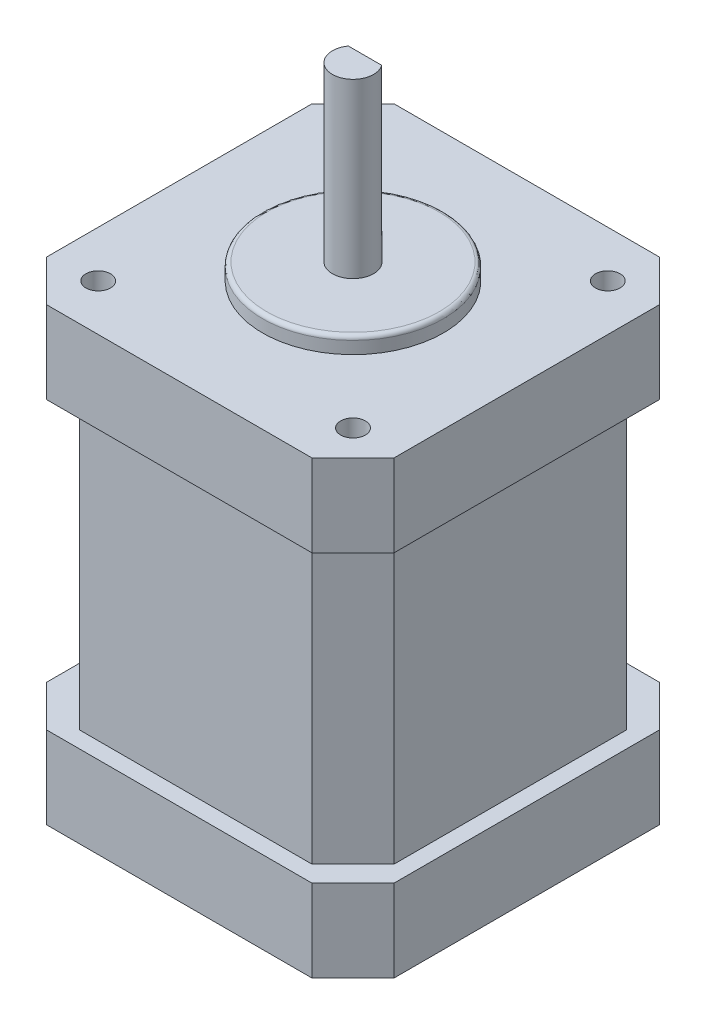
ISO-10303-21;
HEADER;
FILE_DESCRIPTION(('STEP AP214'),'2;1');
FILE_NAME('part.step','',(''),(''),'','','');
FILE_SCHEMA(('AUTOMOTIVE_DESIGN { 1 0 10303 214 1 1 1 1 }'));
ENDSEC;
DATA;
#1=APPLICATION_CONTEXT('core data for automotive mechanical design processes');
#2=APPLICATION_PROTOCOL_DEFINITION('international standard','automotive_design',2000,#1);
#3=PRODUCT_CONTEXT('',#1,'mechanical');
#4=PRODUCT('Part','Part','',(#3));
#5=PRODUCT_RELATED_PRODUCT_CATEGORY('part','',(#4));
#6=PRODUCT_DEFINITION_FORMATION('','',#4);
#7=PRODUCT_DEFINITION_CONTEXT('part definition',#1,'design');
#8=PRODUCT_DEFINITION('design','',#6,#7);
#9=PRODUCT_DEFINITION_SHAPE('','',#8);
#10=(LENGTH_UNIT() NAMED_UNIT(*) SI_UNIT(.MILLI.,.METRE.));
#11=(NAMED_UNIT(*) PLANE_ANGLE_UNIT() SI_UNIT($,.RADIAN.));
#12=(NAMED_UNIT(*) SI_UNIT($,.STERADIAN.) SOLID_ANGLE_UNIT());
#13=UNCERTAINTY_MEASURE_WITH_UNIT(LENGTH_MEASURE(1.E-05),#10,'distance_accuracy_value','');
#14=(GEOMETRIC_REPRESENTATION_CONTEXT(3) GLOBAL_UNCERTAINTY_ASSIGNED_CONTEXT((#13)) GLOBAL_UNIT_ASSIGNED_CONTEXT((#10,
#11,#12)) REPRESENTATION_CONTEXT('',''));
#15=CARTESIAN_POINT('',(0.,0.,0.));
#16=DIRECTION('',(0.,0.,1.));
#17=DIRECTION('',(1.,0.,0.));
#18=AXIS2_PLACEMENT_3D('',#15,#16,#17);
#19=CARTESIAN_POINT('',(0.,77.8,0.));
#20=DIRECTION('',(0.,1.,0.));
#21=DIRECTION('',(0.,0.,1.));
#22=AXIS2_PLACEMENT_3D('',#19,#20,#21);
#23=PLANE('',#22);
#24=DIRECTION('',(1.,0.,0.));
#25=VECTOR('',#24,1.);
#26=CARTESIAN_POINT('',(-3.80876099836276,77.8,-1.4600250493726));
#27=LINE('',#26,#25);
#28=CARTESIAN_POINT('',(2.02936612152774,77.8,-1.4600250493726));
#29=VERTEX_POINT('',#28);
#30=CARTESIAN_POINT('',(-2.02936612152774,77.8,-1.4600250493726));
#31=VERTEX_POINT('',#30);
#32=EDGE_CURVE('E210',#29,#31,#27,.F.);
#33=ORIENTED_EDGE('',*,*,#32,.T.);
#34=CARTESIAN_POINT('',(0.,77.8,0.));
#35=DIRECTION('',(0.,-1.,0.));
#36=DIRECTION('',(0.,0.,-1.));
#37=AXIS2_PLACEMENT_3D('',#34,#35,#36);
#38=CIRCLE('',#37,2.5);
#39=EDGE_CURVE('E200',#29,#31,#38,.T.);
#40=ORIENTED_EDGE('',*,*,#39,.F.);
#41=EDGE_LOOP('',(#33,#40));
#42=FACE_BOUND('',#41,.T.);
#43=ADVANCED_FACE('F17',(#42),#23,.T.);
#44=CARTESIAN_POINT('',(0.,59.8,0.));
#45=DIRECTION('',(0.,1.,0.));
#46=DIRECTION('',(0.,0.,1.));
#47=AXIS2_PLACEMENT_3D('',#44,#45,#46);
#48=PLANE('',#47);
#49=CARTESIAN_POINT('',(0.,59.8,0.));
#50=DIRECTION('',(0.,-1.,0.));
#51=DIRECTION('',(0.,0.,-1.));
#52=AXIS2_PLACEMENT_3D('',#49,#50,#51);
#53=CIRCLE('',#52,2.5);
#54=CARTESIAN_POINT('',(-2.02936612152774,59.8,-1.4600250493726));
#55=VERTEX_POINT('',#54);
#56=CARTESIAN_POINT('',(2.02936612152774,59.8,-1.4600250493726));
#57=VERTEX_POINT('',#56);
#58=EDGE_CURVE('E194',#55,#57,#53,.T.);
#59=ORIENTED_EDGE('',*,*,#58,.F.);
#60=DIRECTION('',(1.,0.,0.));
#61=VECTOR('',#60,1.);
#62=CARTESIAN_POINT('',(-3.80876099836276,59.8,-1.4600250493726));
#63=LINE('',#62,#61);
#64=EDGE_CURVE('E212',#55,#57,#63,.T.);
#65=ORIENTED_EDGE('',*,*,#64,.T.);
#66=EDGE_LOOP('',(#59,#65));
#67=FACE_BOUND('',#66,.T.);
#68=ADVANCED_FACE('F286',(#67),#48,.T.);
#69=CARTESIAN_POINT('',(-3.80876099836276,59.8,-1.4600250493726));
#70=DIRECTION('',(0.,0.,1.));
#71=DIRECTION('',(1.,0.,0.));
#72=AXIS2_PLACEMENT_3D('',#69,#70,#71);
#73=PLANE('',#72);
#74=DIRECTION('',(0.,-1.,0.));
#75=VECTOR('',#74,1.);
#76=CARTESIAN_POINT('',(2.02936612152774,77.8,-1.4600250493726));
#77=LINE('',#76,#75);
#78=EDGE_CURVE('E206',#57,#29,#77,.F.);
#79=ORIENTED_EDGE('',*,*,#78,.F.);
#80=ORIENTED_EDGE('',*,*,#64,.F.);
#81=DIRECTION('',(0.,-1.,0.));
#82=VECTOR('',#81,1.);
#83=CARTESIAN_POINT('',(-2.02936612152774,77.8,-1.4600250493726));
#84=LINE('',#83,#82);
#85=EDGE_CURVE('E204',#31,#55,#84,.T.);
#86=ORIENTED_EDGE('',*,*,#85,.F.);
#87=ORIENTED_EDGE('',*,*,#32,.F.);
#88=EDGE_LOOP('',(#79,#80,#86,#87));
#89=FACE_BOUND('',#88,.T.);
#90=ADVANCED_FACE('F214',(#89),#73,.F.);
#91=CARTESIAN_POINT('',(0.,77.8,0.));
#92=DIRECTION('',(0.,-1.,0.));
#93=DIRECTION('',(0.,0.,-1.));
#94=AXIS2_PLACEMENT_3D('',#91,#92,#93);
#95=CYLINDRICAL_SURFACE('',#94,2.5);
#96=CARTESIAN_POINT('',(0.,56.8,0.));
#97=DIRECTION('',(0.,-1.,0.));
#98=DIRECTION('',(0.,0.,-1.));
#99=AXIS2_PLACEMENT_3D('',#96,#97,#98);
#100=CIRCLE('',#99,2.5);
#101=CARTESIAN_POINT('',(0.,56.8,-2.5));
#102=VERTEX_POINT('',#101);
#103=EDGE_CURVE('E248',#102,#102,#100,.T.);
#104=ORIENTED_EDGE('',*,*,#103,.F.);
#105=EDGE_LOOP('',(#104));
#106=FACE_BOUND('',#105,.T.);
#107=ORIENTED_EDGE('',*,*,#58,.T.);
#108=ORIENTED_EDGE('',*,*,#78,.T.);
#109=ORIENTED_EDGE('',*,*,#39,.T.);
#110=ORIENTED_EDGE('',*,*,#85,.T.);
#111=EDGE_LOOP('',(#107,#108,#109,#110));
#112=FACE_BOUND('',#111,.T.);
#113=ADVANCED_FACE('F202',(#106,#112),#95,.T.);
#114=CARTESIAN_POINT('',(0.,56.8,0.));
#115=DIRECTION('',(0.,1.,0.));
#116=DIRECTION('',(0.,0.,1.));
#117=AXIS2_PLACEMENT_3D('',#114,#115,#116);
#118=PLANE('',#117);
#119=ORIENTED_EDGE('',*,*,#103,.T.);
#120=EDGE_LOOP('',(#119));
#121=FACE_BOUND('',#120,.T.);
#122=CARTESIAN_POINT('',(0.,56.8,0.));
#123=DIRECTION('',(0.,-1.,0.));
#124=DIRECTION('',(0.,0.,-1.));
#125=AXIS2_PLACEMENT_3D('',#122,#123,#124);
#126=CIRCLE('',#125,10.5);
#127=CARTESIAN_POINT('',(0.,56.8,-10.5));
#128=VERTEX_POINT('',#127);
#129=CARTESIAN_POINT('',(0.,56.8,10.5));
#130=VERTEX_POINT('',#129);
#131=EDGE_CURVE('E251',#128,#130,#126,.T.);
#132=ORIENTED_EDGE('',*,*,#131,.F.);
#133=CARTESIAN_POINT('',(0.,56.8,0.));
#134=DIRECTION('',(0.,-1.,0.));
#135=DIRECTION('',(0.,0.,1.));
#136=AXIS2_PLACEMENT_3D('',#133,#134,#135);
#137=CIRCLE('',#136,10.5);
#138=EDGE_CURVE('E247',#130,#128,#137,.T.);
#139=ORIENTED_EDGE('',*,*,#138,.F.);
#140=EDGE_LOOP('',(#132,#139));
#141=FACE_BOUND('',#140,.T.);
#142=ADVANCED_FACE('F260',(#121,#141),#118,.T.);
#143=CARTESIAN_POINT('',(15.5,49.8,15.5));
#144=DIRECTION('',(0.,1.,0.));
#145=DIRECTION('',(0.,0.,1.));
#146=AXIS2_PLACEMENT_3D('',#143,#144,#145);
#147=PLANE('',#146);
#148=CARTESIAN_POINT('',(15.5,49.8,15.5));
#149=DIRECTION('',(0.,1.,0.));
#150=DIRECTION('',(0.,0.,1.));
#151=AXIS2_PLACEMENT_3D('',#148,#149,#150);
#152=CIRCLE('',#151,1.5);
#153=CARTESIAN_POINT('',(15.5,49.8,17.));
#154=VERTEX_POINT('',#153);
#155=EDGE_CURVE('E244',#154,#154,#152,.T.);
#156=ORIENTED_EDGE('',*,*,#155,.T.);
#157=EDGE_LOOP('',(#156));
#158=FACE_BOUND('',#157,.T.);
#159=ADVANCED_FACE('F278',(#158),#147,.T.);
#160=CARTESIAN_POINT('',(-15.5,49.8,15.5));
#161=DIRECTION('',(0.,1.,0.));
#162=DIRECTION('',(0.,0.,1.));
#163=AXIS2_PLACEMENT_3D('',#160,#161,#162);
#164=PLANE('',#163);
#165=CARTESIAN_POINT('',(-15.5,49.8,15.5));
#166=DIRECTION('',(0.,1.,0.));
#167=DIRECTION('',(0.,0.,1.));
#168=AXIS2_PLACEMENT_3D('',#165,#166,#167);
#169=CIRCLE('',#168,1.5);
#170=CARTESIAN_POINT('',(-15.5,49.8,17.));
#171=VERTEX_POINT('',#170);
#172=EDGE_CURVE('E241',#171,#171,#169,.T.);
#173=ORIENTED_EDGE('',*,*,#172,.T.);
#174=EDGE_LOOP('',(#173));
#175=FACE_BOUND('',#174,.T.);
#176=ADVANCED_FACE('F697',(#175),#164,.T.);
#177=CARTESIAN_POINT('',(15.5,49.8,-15.5));
#178=DIRECTION('',(0.,1.,0.));
#179=DIRECTION('',(0.,0.,1.));
#180=AXIS2_PLACEMENT_3D('',#177,#178,#179);
#181=PLANE('',#180);
#182=CARTESIAN_POINT('',(15.5,49.8,-15.5));
#183=DIRECTION('',(0.,1.,0.));
#184=DIRECTION('',(0.,0.,1.));
#185=AXIS2_PLACEMENT_3D('',#182,#183,#184);
#186=CIRCLE('',#185,1.5);
#187=CARTESIAN_POINT('',(15.5,49.8,-14.));
#188=VERTEX_POINT('',#187);
#189=EDGE_CURVE('E238',#188,#188,#186,.T.);
#190=ORIENTED_EDGE('',*,*,#189,.T.);
#191=EDGE_LOOP('',(#190));
#192=FACE_BOUND('',#191,.T.);
#193=ADVANCED_FACE('F694',(#192),#181,.T.);
#194=CARTESIAN_POINT('',(-15.5,49.8,-15.5));
#195=DIRECTION('',(0.,1.,0.));
#196=DIRECTION('',(0.,0.,1.));
#197=AXIS2_PLACEMENT_3D('',#194,#195,#196);
#198=PLANE('',#197);
#199=CARTESIAN_POINT('',(-15.5,49.8,-15.5));
#200=DIRECTION('',(0.,1.,0.));
#201=DIRECTION('',(0.,0.,1.));
#202=AXIS2_PLACEMENT_3D('',#199,#200,#201);
#203=CIRCLE('',#202,1.5);
#204=CARTESIAN_POINT('',(-15.5,49.8,-14.));
#205=VERTEX_POINT('',#204);
#206=EDGE_CURVE('E235',#205,#205,#203,.T.);
#207=ORIENTED_EDGE('',*,*,#206,.T.);
#208=EDGE_LOOP('',(#207));
#209=FACE_BOUND('',#208,.T.);
#210=ADVANCED_FACE('F430',(#209),#198,.T.);
#211=CARTESIAN_POINT('',(0.,56.3,0.));
#212=DIRECTION('',(0.,1.,0.));
#213=DIRECTION('',(0.,0.,1.));
#214=AXIS2_PLACEMENT_3D('',#211,#212,#213);
#215=TOROIDAL_SURFACE('',#214,10.5,0.5);
#216=CARTESIAN_POINT('',(0.,56.3,0.));
#217=DIRECTION('',(0.,-1.,0.));
#218=DIRECTION('',(0.,0.,-1.));
#219=AXIS2_PLACEMENT_3D('',#216,#217,#218);
#220=CIRCLE('',#219,11.);
#221=CARTESIAN_POINT('',(0.,56.3,-11.));
#222=VERTEX_POINT('',#221);
#223=EDGE_CURVE('E234',#222,#222,#220,.T.);
#224=ORIENTED_EDGE('',*,*,#223,.F.);
#225=EDGE_LOOP('',(#224));
#226=FACE_BOUND('',#225,.T.);
#227=ORIENTED_EDGE('',*,*,#138,.T.);
#228=ORIENTED_EDGE('',*,*,#131,.T.);
#229=EDGE_LOOP('',(#227,#228));
#230=FACE_BOUND('',#229,.T.);
#231=ADVANCED_FACE('F255',(#226,#230),#215,.T.);
#232=CARTESIAN_POINT('',(15.5,49.8,15.5));
#233=DIRECTION('',(0.,1.,0.));
#234=DIRECTION('',(0.,0.,1.));
#235=AXIS2_PLACEMENT_3D('',#232,#233,#234);
#236=CYLINDRICAL_SURFACE('',#235,1.5);
#237=ORIENTED_EDGE('',*,*,#155,.F.);
#238=EDGE_LOOP('',(#237));
#239=FACE_BOUND('',#238,.T.);
#240=CARTESIAN_POINT('',(15.5,54.8,15.5));
#241=DIRECTION('',(0.,1.,0.));
#242=DIRECTION('',(0.,0.,1.));
#243=AXIS2_PLACEMENT_3D('',#240,#241,#242);
#244=CIRCLE('',#243,1.5);
#245=CARTESIAN_POINT('',(15.5,54.8,17.));
#246=VERTEX_POINT('',#245);
#247=EDGE_CURVE('E231',#246,#246,#244,.T.);
#248=ORIENTED_EDGE('',*,*,#247,.T.);
#249=EDGE_LOOP('',(#248));
#250=FACE_BOUND('',#249,.T.);
#251=ADVANCED_FACE('F422',(#239,#250),#236,.F.);
#252=CARTESIAN_POINT('',(-15.5,49.8,15.5));
#253=DIRECTION('',(0.,1.,0.));
#254=DIRECTION('',(0.,0.,1.));
#255=AXIS2_PLACEMENT_3D('',#252,#253,#254);
#256=CYLINDRICAL_SURFACE('',#255,1.5);
#257=ORIENTED_EDGE('',*,*,#172,.F.);
#258=EDGE_LOOP('',(#257));
#259=FACE_BOUND('',#258,.T.);
#260=CARTESIAN_POINT('',(-15.5,54.8,15.5));
#261=DIRECTION('',(0.,1.,0.));
#262=DIRECTION('',(0.,0.,1.));
#263=AXIS2_PLACEMENT_3D('',#260,#261,#262);
#264=CIRCLE('',#263,1.5);
#265=CARTESIAN_POINT('',(-15.5,54.8,17.));
#266=VERTEX_POINT('',#265);
#267=EDGE_CURVE('E228',#266,#266,#264,.T.);
#268=ORIENTED_EDGE('',*,*,#267,.T.);
#269=EDGE_LOOP('',(#268));
#270=FACE_BOUND('',#269,.T.);
#271=ADVANCED_FACE('F418',(#259,#270),#256,.F.);
#272=CARTESIAN_POINT('',(15.5,49.8,-15.5));
#273=DIRECTION('',(0.,1.,0.));
#274=DIRECTION('',(0.,0.,1.));
#275=AXIS2_PLACEMENT_3D('',#272,#273,#274);
#276=CYLINDRICAL_SURFACE('',#275,1.5);
#277=ORIENTED_EDGE('',*,*,#189,.F.);
#278=EDGE_LOOP('',(#277));
#279=FACE_BOUND('',#278,.T.);
#280=CARTESIAN_POINT('',(15.5,54.8,-15.5));
#281=DIRECTION('',(0.,1.,0.));
#282=DIRECTION('',(0.,0.,1.));
#283=AXIS2_PLACEMENT_3D('',#280,#281,#282);
#284=CIRCLE('',#283,1.5);
#285=CARTESIAN_POINT('',(15.5,54.8,-14.));
#286=VERTEX_POINT('',#285);
#287=EDGE_CURVE('E225',#286,#286,#284,.T.);
#288=ORIENTED_EDGE('',*,*,#287,.T.);
#289=EDGE_LOOP('',(#288));
#290=FACE_BOUND('',#289,.T.);
#291=ADVANCED_FACE('F414',(#279,#290),#276,.F.);
#292=CARTESIAN_POINT('',(-15.5,49.8,-15.5));
#293=DIRECTION('',(0.,1.,0.));
#294=DIRECTION('',(0.,0.,1.));
#295=AXIS2_PLACEMENT_3D('',#292,#293,#294);
#296=CYLINDRICAL_SURFACE('',#295,1.5);
#297=ORIENTED_EDGE('',*,*,#206,.F.);
#298=EDGE_LOOP('',(#297));
#299=FACE_BOUND('',#298,.T.);
#300=CARTESIAN_POINT('',(-15.5,54.8,-15.5));
#301=DIRECTION('',(0.,1.,0.));
#302=DIRECTION('',(0.,0.,1.));
#303=AXIS2_PLACEMENT_3D('',#300,#301,#302);
#304=CIRCLE('',#303,1.5);
#305=CARTESIAN_POINT('',(-15.5,54.8,-14.));
#306=VERTEX_POINT('',#305);
#307=EDGE_CURVE('E222',#306,#306,#304,.T.);
#308=ORIENTED_EDGE('',*,*,#307,.T.);
#309=EDGE_LOOP('',(#308));
#310=FACE_BOUND('',#309,.T.);
#311=ADVANCED_FACE('F410',(#299,#310),#296,.F.);
#312=CARTESIAN_POINT('',(0.,56.8,0.));
#313=DIRECTION('',(0.,-1.,0.));
#314=DIRECTION('',(0.,0.,-1.));
#315=AXIS2_PLACEMENT_3D('',#312,#313,#314);
#316=CYLINDRICAL_SURFACE('',#315,11.);
#317=ORIENTED_EDGE('',*,*,#223,.T.);
#318=EDGE_LOOP('',(#317));
#319=FACE_BOUND('',#318,.T.);
#320=CARTESIAN_POINT('',(0.,54.8,0.));
#321=DIRECTION('',(0.,-1.,0.));
#322=DIRECTION('',(0.,0.,-1.));
#323=AXIS2_PLACEMENT_3D('',#320,#321,#322);
#324=CIRCLE('',#323,11.);
#325=CARTESIAN_POINT('',(0.,54.8,-11.));
#326=VERTEX_POINT('',#325);
#327=EDGE_CURVE('E218',#326,#326,#324,.F.);
#328=ORIENTED_EDGE('',*,*,#327,.T.);
#329=EDGE_LOOP('',(#328));
#330=FACE_BOUND('',#329,.T.);
#331=ADVANCED_FACE('F406',(#319,#330),#316,.T.);
#332=CARTESIAN_POINT('',(0.,54.8,0.));
#333=DIRECTION('',(0.,-1.,0.));
#334=DIRECTION('',(0.,0.,-1.));
#335=AXIS2_PLACEMENT_3D('',#332,#333,#334);
#336=PLANE('',#335);
#337=ORIENTED_EDGE('',*,*,#327,.F.);
#338=EDGE_LOOP('',(#337));
#339=FACE_BOUND('',#338,.T.);
#340=ORIENTED_EDGE('',*,*,#307,.F.);
#341=EDGE_LOOP('',(#340));
#342=FACE_BOUND('',#341,.T.);
#343=ORIENTED_EDGE('',*,*,#287,.F.);
#344=EDGE_LOOP('',(#343));
#345=FACE_BOUND('',#344,.T.);
#346=ORIENTED_EDGE('',*,*,#267,.F.);
#347=EDGE_LOOP('',(#346));
#348=FACE_BOUND('',#347,.T.);
#349=ORIENTED_EDGE('',*,*,#247,.F.);
#350=EDGE_LOOP('',(#349));
#351=FACE_BOUND('',#350,.T.);
#352=DIRECTION('',(-0.707106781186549,0.,0.707106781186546));
#353=VECTOR('',#352,1.);
#354=CARTESIAN_POINT('',(21.15,54.8,16.15));
#355=LINE('',#354,#353);
#356=CARTESIAN_POINT('',(16.15,54.8,21.15));
#357=VERTEX_POINT('',#356);
#358=CARTESIAN_POINT('',(21.15,54.8,16.15));
#359=VERTEX_POINT('',#358);
#360=EDGE_CURVE('E441',#357,#359,#355,.F.);
#361=ORIENTED_EDGE('',*,*,#360,.T.);
#362=DIRECTION('',(0.,0.,1.));
#363=VECTOR('',#362,1.);
#364=CARTESIAN_POINT('',(21.15,54.8,21.15));
#365=LINE('',#364,#363);
#366=CARTESIAN_POINT('',(21.15,54.8,-16.15));
#367=VERTEX_POINT('',#366);
#368=EDGE_CURVE('E221',#359,#367,#365,.F.);
#369=ORIENTED_EDGE('',*,*,#368,.T.);
#370=DIRECTION('',(0.707106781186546,0.,0.707106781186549));
#371=VECTOR('',#370,1.);
#372=CARTESIAN_POINT('',(16.15,54.8,-21.15));
#373=LINE('',#372,#371);
#374=CARTESIAN_POINT('',(16.15,54.8,-21.15));
#375=VERTEX_POINT('',#374);
#376=EDGE_CURVE('E471',#367,#375,#373,.F.);
#377=ORIENTED_EDGE('',*,*,#376,.T.);
#378=DIRECTION('',(1.,0.,0.));
#379=VECTOR('',#378,1.);
#380=CARTESIAN_POINT('',(-21.15,54.8,-21.15));
#381=LINE('',#380,#379);
#382=CARTESIAN_POINT('',(-16.15,54.8,-21.15));
#383=VERTEX_POINT('',#382);
#384=EDGE_CURVE('E462',#375,#383,#381,.F.);
#385=ORIENTED_EDGE('',*,*,#384,.T.);
#386=DIRECTION('',(0.707106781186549,0.,-0.707106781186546));
#387=VECTOR('',#386,1.);
#388=CARTESIAN_POINT('',(-21.15,54.8,-16.15));
#389=LINE('',#388,#387);
#390=CARTESIAN_POINT('',(-21.15,54.8,-16.15));
#391=VERTEX_POINT('',#390);
#392=EDGE_CURVE('E459',#383,#391,#389,.F.);
#393=ORIENTED_EDGE('',*,*,#392,.T.);
#394=DIRECTION('',(0.,0.,-1.));
#395=VECTOR('',#394,1.);
#396=CARTESIAN_POINT('',(-21.15,54.8,21.15));
#397=LINE('',#396,#395);
#398=CARTESIAN_POINT('',(-21.15,54.8,16.15));
#399=VERTEX_POINT('',#398);
#400=EDGE_CURVE('E453',#391,#399,#397,.F.);
#401=ORIENTED_EDGE('',*,*,#400,.T.);
#402=DIRECTION('',(-0.707106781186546,0.,-0.707106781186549));
#403=VECTOR('',#402,1.);
#404=CARTESIAN_POINT('',(-16.15,54.8,21.15));
#405=LINE('',#404,#403);
#406=CARTESIAN_POINT('',(-16.15,54.8,21.15));
#407=VERTEX_POINT('',#406);
#408=EDGE_CURVE('E450',#399,#407,#405,.F.);
#409=ORIENTED_EDGE('',*,*,#408,.T.);
#410=DIRECTION('',(-1.,0.,0.));
#411=VECTOR('',#410,1.);
#412=CARTESIAN_POINT('',(-21.15,54.8,21.15));
#413=LINE('',#412,#411);
#414=EDGE_CURVE('E444',#407,#357,#413,.F.);
#415=ORIENTED_EDGE('',*,*,#414,.T.);
#416=EDGE_LOOP('',(#361,#369,#377,#385,#393,#401,#409,#415));
#417=FACE_BOUND('',#416,.T.);
#418=ADVANCED_FACE('F402',(#339,#342,#345,#348,#351,#417),#336,.F.);
#419=CARTESIAN_POINT('',(21.15,54.8,21.15));
#420=DIRECTION('',(-1.,0.,0.));
#421=DIRECTION('',(0.,0.,1.));
#422=AXIS2_PLACEMENT_3D('',#419,#420,#421);
#423=PLANE('',#422);
#424=DIRECTION('',(0.,1.,0.));
#425=VECTOR('',#424,1.);
#426=CARTESIAN_POINT('',(21.15,54.8,16.15));
#427=LINE('',#426,#425);
#428=CARTESIAN_POINT('',(21.15,44.8,16.15));
#429=VERTEX_POINT('',#428);
#430=EDGE_CURVE('E439',#359,#429,#427,.F.);
#431=ORIENTED_EDGE('',*,*,#430,.T.);
#432=DIRECTION('',(0.,0.,-1.));
#433=VECTOR('',#432,1.);
#434=CARTESIAN_POINT('',(21.15,44.8,0.));
#435=LINE('',#434,#433);
#436=CARTESIAN_POINT('',(21.15,44.8,-16.15));
#437=VERTEX_POINT('',#436);
#438=EDGE_CURVE('E474',#437,#429,#435,.F.);
#439=ORIENTED_EDGE('',*,*,#438,.F.);
#440=DIRECTION('',(0.,1.,0.));
#441=VECTOR('',#440,1.);
#442=CARTESIAN_POINT('',(21.15,54.8,-16.15));
#443=LINE('',#442,#441);
#444=EDGE_CURVE('E468',#437,#367,#443,.T.);
#445=ORIENTED_EDGE('',*,*,#444,.T.);
#446=ORIENTED_EDGE('',*,*,#368,.F.);
#447=EDGE_LOOP('',(#431,#439,#445,#446));
#448=FACE_BOUND('',#447,.T.);
#449=ADVANCED_FACE('F398',(#448),#423,.F.);
#450=CARTESIAN_POINT('',(21.15,54.8,16.15));
#451=DIRECTION('',(-0.707106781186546,0.,-0.707106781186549));
#452=DIRECTION('',(-0.707106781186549,0.,0.707106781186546));
#453=AXIS2_PLACEMENT_3D('',#450,#451,#452);
#454=PLANE('',#453);
#455=DIRECTION('',(0.,1.,0.));
#456=VECTOR('',#455,1.);
#457=CARTESIAN_POINT('',(16.15,54.8,21.15));
#458=LINE('',#457,#456);
#459=CARTESIAN_POINT('',(16.15,44.8,21.15));
#460=VERTEX_POINT('',#459);
#461=EDGE_CURVE('E446',#357,#460,#458,.F.);
#462=ORIENTED_EDGE('',*,*,#461,.T.);
#463=DIRECTION('',(-0.707106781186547,0.,0.707106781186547));
#464=VECTOR('',#463,1.);
#465=CARTESIAN_POINT('',(21.15,44.8,16.15));
#466=LINE('',#465,#464);
#467=EDGE_CURVE('E477',#429,#460,#466,.T.);
#468=ORIENTED_EDGE('',*,*,#467,.F.);
#469=ORIENTED_EDGE('',*,*,#430,.F.);
#470=ORIENTED_EDGE('',*,*,#360,.F.);
#471=EDGE_LOOP('',(#462,#468,#469,#470));
#472=FACE_BOUND('',#471,.T.);
#473=ADVANCED_FACE('F394',(#472),#454,.F.);
#474=CARTESIAN_POINT('',(-21.15,54.8,21.15));
#475=DIRECTION('',(0.,0.,-1.));
#476=DIRECTION('',(-1.,0.,0.));
#477=AXIS2_PLACEMENT_3D('',#474,#475,#476);
#478=PLANE('',#477);
#479=ORIENTED_EDGE('',*,*,#461,.F.);
#480=ORIENTED_EDGE('',*,*,#414,.F.);
#481=DIRECTION('',(0.,1.,0.));
#482=VECTOR('',#481,1.);
#483=CARTESIAN_POINT('',(-16.15,54.8,21.15));
#484=LINE('',#483,#482);
#485=CARTESIAN_POINT('',(-16.15,44.8,21.15));
#486=VERTEX_POINT('',#485);
#487=EDGE_CURVE('E448',#407,#486,#484,.F.);
#488=ORIENTED_EDGE('',*,*,#487,.T.);
#489=DIRECTION('',(1.,0.,0.));
#490=VECTOR('',#489,1.);
#491=CARTESIAN_POINT('',(0.,44.8,21.15));
#492=LINE('',#491,#490);
#493=EDGE_CURVE('E480',#460,#486,#492,.F.);
#494=ORIENTED_EDGE('',*,*,#493,.F.);
#495=EDGE_LOOP('',(#479,#480,#488,#494));
#496=FACE_BOUND('',#495,.T.);
#497=ADVANCED_FACE('F390',(#496),#478,.F.);
#498=CARTESIAN_POINT('',(-16.15,54.8,21.15));
#499=DIRECTION('',(0.707106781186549,0.,-0.707106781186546));
#500=DIRECTION('',(-0.707106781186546,0.,-0.707106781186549));
#501=AXIS2_PLACEMENT_3D('',#498,#499,#500);
#502=PLANE('',#501);
#503=DIRECTION('',(0.,1.,0.));
#504=VECTOR('',#503,1.);
#505=CARTESIAN_POINT('',(-21.15,54.8,16.15));
#506=LINE('',#505,#504);
#507=CARTESIAN_POINT('',(-21.15,44.8,16.15));
#508=VERTEX_POINT('',#507);
#509=EDGE_CURVE('E455',#399,#508,#506,.F.);
#510=ORIENTED_EDGE('',*,*,#509,.T.);
#511=DIRECTION('',(-0.707106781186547,0.,-0.707106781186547));
#512=VECTOR('',#511,1.);
#513=CARTESIAN_POINT('',(-16.15,44.8,21.15));
#514=LINE('',#513,#512);
#515=EDGE_CURVE('E483',#486,#508,#514,.T.);
#516=ORIENTED_EDGE('',*,*,#515,.F.);
#517=ORIENTED_EDGE('',*,*,#487,.F.);
#518=ORIENTED_EDGE('',*,*,#408,.F.);
#519=EDGE_LOOP('',(#510,#516,#517,#518));
#520=FACE_BOUND('',#519,.T.);
#521=ADVANCED_FACE('F386',(#520),#502,.F.);
#522=CARTESIAN_POINT('',(-21.15,54.8,21.15));
#523=DIRECTION('',(1.,0.,0.));
#524=DIRECTION('',(0.,0.,-1.));
#525=AXIS2_PLACEMENT_3D('',#522,#523,#524);
#526=PLANE('',#525);
#527=ORIENTED_EDGE('',*,*,#509,.F.);
#528=ORIENTED_EDGE('',*,*,#400,.F.);
#529=DIRECTION('',(0.,1.,0.));
#530=VECTOR('',#529,1.);
#531=CARTESIAN_POINT('',(-21.15,54.8,-16.15));
#532=LINE('',#531,#530);
#533=CARTESIAN_POINT('',(-21.15,44.8,-16.15));
#534=VERTEX_POINT('',#533);
#535=EDGE_CURVE('E457',#391,#534,#532,.F.);
#536=ORIENTED_EDGE('',*,*,#535,.T.);
#537=DIRECTION('',(0.,0.,-1.));
#538=VECTOR('',#537,1.);
#539=CARTESIAN_POINT('',(-21.15,44.8,0.));
#540=LINE('',#539,#538);
#541=EDGE_CURVE('E486',#508,#534,#540,.T.);
#542=ORIENTED_EDGE('',*,*,#541,.F.);
#543=EDGE_LOOP('',(#527,#528,#536,#542));
#544=FACE_BOUND('',#543,.T.);
#545=ADVANCED_FACE('F382',(#544),#526,.F.);
#546=CARTESIAN_POINT('',(-21.15,54.8,-16.15));
#547=DIRECTION('',(0.707106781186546,0.,0.707106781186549));
#548=DIRECTION('',(0.707106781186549,0.,-0.707106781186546));
#549=AXIS2_PLACEMENT_3D('',#546,#547,#548);
#550=PLANE('',#549);
#551=DIRECTION('',(0.,1.,0.));
#552=VECTOR('',#551,1.);
#553=CARTESIAN_POINT('',(-16.15,54.8,-21.15));
#554=LINE('',#553,#552);
#555=CARTESIAN_POINT('',(-16.15,44.8,-21.15));
#556=VERTEX_POINT('',#555);
#557=EDGE_CURVE('E464',#383,#556,#554,.F.);
#558=ORIENTED_EDGE('',*,*,#557,.T.);
#559=DIRECTION('',(0.707106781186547,0.,-0.707106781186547));
#560=VECTOR('',#559,1.);
#561=CARTESIAN_POINT('',(-21.15,44.8,-16.15));
#562=LINE('',#561,#560);
#563=EDGE_CURVE('E489',#534,#556,#562,.T.);
#564=ORIENTED_EDGE('',*,*,#563,.F.);
#565=ORIENTED_EDGE('',*,*,#535,.F.);
#566=ORIENTED_EDGE('',*,*,#392,.F.);
#567=EDGE_LOOP('',(#558,#564,#565,#566));
#568=FACE_BOUND('',#567,.T.);
#569=ADVANCED_FACE('F378',(#568),#550,.F.);
#570=CARTESIAN_POINT('',(-21.15,54.8,-21.15));
#571=DIRECTION('',(0.,0.,1.));
#572=DIRECTION('',(1.,0.,0.));
#573=AXIS2_PLACEMENT_3D('',#570,#571,#572);
#574=PLANE('',#573);
#575=ORIENTED_EDGE('',*,*,#557,.F.);
#576=ORIENTED_EDGE('',*,*,#384,.F.);
#577=DIRECTION('',(0.,1.,0.));
#578=VECTOR('',#577,1.);
#579=CARTESIAN_POINT('',(16.15,54.8,-21.15));
#580=LINE('',#579,#578);
#581=CARTESIAN_POINT('',(16.15,44.8,-21.15));
#582=VERTEX_POINT('',#581);
#583=EDGE_CURVE('E466',#375,#582,#580,.F.);
#584=ORIENTED_EDGE('',*,*,#583,.T.);
#585=DIRECTION('',(1.,0.,0.));
#586=VECTOR('',#585,1.);
#587=CARTESIAN_POINT('',(0.,44.8,-21.15));
#588=LINE('',#587,#586);
#589=EDGE_CURVE('E492',#556,#582,#588,.T.);
#590=ORIENTED_EDGE('',*,*,#589,.F.);
#591=EDGE_LOOP('',(#575,#576,#584,#590));
#592=FACE_BOUND('',#591,.T.);
#593=ADVANCED_FACE('F374',(#592),#574,.F.);
#594=CARTESIAN_POINT('',(16.15,54.8,-21.15));
#595=DIRECTION('',(-0.707106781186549,0.,0.707106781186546));
#596=DIRECTION('',(0.707106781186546,0.,0.707106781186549));
#597=AXIS2_PLACEMENT_3D('',#594,#595,#596);
#598=PLANE('',#597);
#599=ORIENTED_EDGE('',*,*,#444,.F.);
#600=DIRECTION('',(0.707106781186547,0.,0.707106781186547));
#601=VECTOR('',#600,1.);
#602=CARTESIAN_POINT('',(16.15,44.8,-21.15));
#603=LINE('',#602,#601);
#604=EDGE_CURVE('E495',#582,#437,#603,.T.);
#605=ORIENTED_EDGE('',*,*,#604,.F.);
#606=ORIENTED_EDGE('',*,*,#583,.F.);
#607=ORIENTED_EDGE('',*,*,#376,.F.);
#608=EDGE_LOOP('',(#599,#605,#606,#607));
#609=FACE_BOUND('',#608,.T.);
#610=ADVANCED_FACE('F370',(#609),#598,.F.);
#611=CARTESIAN_POINT('',(0.,44.8,0.));
#612=DIRECTION('',(0.,-1.,0.));
#613=DIRECTION('',(0.,0.,-1.));
#614=AXIS2_PLACEMENT_3D('',#611,#612,#613);
#615=PLANE('',#614);
#616=DIRECTION('',(0.,0.,-1.));
#617=VECTOR('',#616,1.);
#618=CARTESIAN_POINT('',(-19.15,44.8,19.15));
#619=LINE('',#618,#617);
#620=CARTESIAN_POINT('',(-19.15,44.8,-14.15));
#621=VERTEX_POINT('',#620);
#622=CARTESIAN_POINT('',(-19.15,44.8,14.15));
#623=VERTEX_POINT('',#622);
#624=EDGE_CURVE('E513',#621,#623,#619,.F.);
#625=ORIENTED_EDGE('',*,*,#624,.T.);
#626=DIRECTION('',(-0.707106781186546,0.,-0.707106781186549));
#627=VECTOR('',#626,1.);
#628=CARTESIAN_POINT('',(-14.15,44.8,19.15));
#629=LINE('',#628,#627);
#630=CARTESIAN_POINT('',(-14.15,44.8,19.15));
#631=VERTEX_POINT('',#630);
#632=EDGE_CURVE('E518',#623,#631,#629,.F.);
#633=ORIENTED_EDGE('',*,*,#632,.T.);
#634=DIRECTION('',(-1.,0.,0.));
#635=VECTOR('',#634,1.);
#636=CARTESIAN_POINT('',(-19.15,44.8,19.15));
#637=LINE('',#636,#635);
#638=CARTESIAN_POINT('',(14.15,44.8,19.15));
#639=VERTEX_POINT('',#638);
#640=EDGE_CURVE('E523',#631,#639,#637,.F.);
#641=ORIENTED_EDGE('',*,*,#640,.T.);
#642=DIRECTION('',(-0.707106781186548,0.,0.707106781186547));
#643=VECTOR('',#642,1.);
#644=CARTESIAN_POINT('',(19.15,44.8,14.15));
#645=LINE('',#644,#643);
#646=CARTESIAN_POINT('',(19.15,44.8,14.15));
#647=VERTEX_POINT('',#646);
#648=EDGE_CURVE('E528',#639,#647,#645,.F.);
#649=ORIENTED_EDGE('',*,*,#648,.T.);
#650=DIRECTION('',(0.,0.,1.));
#651=VECTOR('',#650,1.);
#652=CARTESIAN_POINT('',(19.15,44.8,19.15));
#653=LINE('',#652,#651);
#654=CARTESIAN_POINT('',(19.15,44.8,-14.15));
#655=VERTEX_POINT('',#654);
#656=EDGE_CURVE('E535',#647,#655,#653,.F.);
#657=ORIENTED_EDGE('',*,*,#656,.T.);
#658=DIRECTION('',(0.707106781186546,0.,0.707106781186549));
#659=VECTOR('',#658,1.);
#660=CARTESIAN_POINT('',(14.15,44.8,-19.15));
#661=LINE('',#660,#659);
#662=CARTESIAN_POINT('',(14.15,44.8,-19.15));
#663=VERTEX_POINT('',#662);
#664=EDGE_CURVE('E498',#655,#663,#661,.F.);
#665=ORIENTED_EDGE('',*,*,#664,.T.);
#666=DIRECTION('',(1.,0.,0.));
#667=VECTOR('',#666,1.);
#668=CARTESIAN_POINT('',(-19.15,44.8,-19.15));
#669=LINE('',#668,#667);
#670=CARTESIAN_POINT('',(-14.15,44.8,-19.15));
#671=VERTEX_POINT('',#670);
#672=EDGE_CURVE('E503',#663,#671,#669,.F.);
#673=ORIENTED_EDGE('',*,*,#672,.T.);
#674=DIRECTION('',(0.707106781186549,0.,-0.707106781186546));
#675=VECTOR('',#674,1.);
#676=CARTESIAN_POINT('',(-19.15,44.8,-14.15));
#677=LINE('',#676,#675);
#678=EDGE_CURVE('E508',#671,#621,#677,.F.);
#679=ORIENTED_EDGE('',*,*,#678,.T.);
#680=EDGE_LOOP('',(#625,#633,#641,#649,#657,#665,#673,#679));
#681=FACE_BOUND('',#680,.T.);
#682=ORIENTED_EDGE('',*,*,#589,.T.);
#683=ORIENTED_EDGE('',*,*,#604,.T.);
#684=ORIENTED_EDGE('',*,*,#438,.T.);
#685=ORIENTED_EDGE('',*,*,#467,.T.);
#686=ORIENTED_EDGE('',*,*,#493,.T.);
#687=ORIENTED_EDGE('',*,*,#515,.T.);
#688=ORIENTED_EDGE('',*,*,#541,.T.);
#689=ORIENTED_EDGE('',*,*,#563,.T.);
#690=EDGE_LOOP('',(#682,#683,#684,#685,#686,#687,#688,#689));
#691=FACE_BOUND('',#690,.T.);
#692=ADVANCED_FACE('F366',(#681,#691),#615,.T.);
#693=CARTESIAN_POINT('',(14.15,44.8,-19.15));
#694=DIRECTION('',(-0.707106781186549,0.,0.707106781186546));
#695=DIRECTION('',(0.707106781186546,0.,0.707106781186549));
#696=AXIS2_PLACEMENT_3D('',#693,#694,#695);
#697=PLANE('',#696);
#698=DIRECTION('',(0.,1.,0.));
#699=VECTOR('',#698,1.);
#700=CARTESIAN_POINT('',(19.15,44.8,-14.15));
#701=LINE('',#700,#699);
#702=CARTESIAN_POINT('',(19.15,10.,-14.15));
#703=VERTEX_POINT('',#702);
#704=EDGE_CURVE('E530',#655,#703,#701,.F.);
#705=ORIENTED_EDGE('',*,*,#704,.T.);
#706=DIRECTION('',(-0.707106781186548,0.,-0.707106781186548));
#707=VECTOR('',#706,1.);
#708=CARTESIAN_POINT('',(19.15,10.,-14.15));
#709=LINE('',#708,#707);
#710=CARTESIAN_POINT('',(14.15,10.,-19.15));
#711=VERTEX_POINT('',#710);
#712=EDGE_CURVE('E538',#703,#711,#709,.T.);
#713=ORIENTED_EDGE('',*,*,#712,.T.);
#714=DIRECTION('',(0.,1.,0.));
#715=VECTOR('',#714,1.);
#716=CARTESIAN_POINT('',(14.15,44.8,-19.15));
#717=LINE('',#716,#715);
#718=EDGE_CURVE('E500',#711,#663,#717,.T.);
#719=ORIENTED_EDGE('',*,*,#718,.T.);
#720=ORIENTED_EDGE('',*,*,#664,.F.);
#721=EDGE_LOOP('',(#705,#713,#719,#720));
#722=FACE_BOUND('',#721,.T.);
#723=ADVANCED_FACE('F362',(#722),#697,.F.);
#724=CARTESIAN_POINT('',(-19.15,44.8,-19.15));
#725=DIRECTION('',(0.,0.,1.));
#726=DIRECTION('',(1.,0.,0.));
#727=AXIS2_PLACEMENT_3D('',#724,#725,#726);
#728=PLANE('',#727);
#729=DIRECTION('',(0.,1.,0.));
#730=VECTOR('',#729,1.);
#731=CARTESIAN_POINT('',(-14.15,44.8,-19.15));
#732=LINE('',#731,#730);
#733=CARTESIAN_POINT('',(-14.15,10.,-19.15));
#734=VERTEX_POINT('',#733);
#735=EDGE_CURVE('E505',#734,#671,#732,.T.);
#736=ORIENTED_EDGE('',*,*,#735,.T.);
#737=ORIENTED_EDGE('',*,*,#672,.F.);
#738=ORIENTED_EDGE('',*,*,#718,.F.);
#739=DIRECTION('',(1.,0.,0.));
#740=VECTOR('',#739,1.);
#741=CARTESIAN_POINT('',(0.,10.,-19.15));
#742=LINE('',#741,#740);
#743=EDGE_CURVE('E540',#711,#734,#742,.F.);
#744=ORIENTED_EDGE('',*,*,#743,.T.);
#745=EDGE_LOOP('',(#736,#737,#738,#744));
#746=FACE_BOUND('',#745,.T.);
#747=ADVANCED_FACE('F358',(#746),#728,.F.);
#748=CARTESIAN_POINT('',(-19.15,44.8,-14.15));
#749=DIRECTION('',(0.707106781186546,0.,0.707106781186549));
#750=DIRECTION('',(0.707106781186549,0.,-0.707106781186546));
#751=AXIS2_PLACEMENT_3D('',#748,#749,#750);
#752=PLANE('',#751);
#753=ORIENTED_EDGE('',*,*,#735,.F.);
#754=DIRECTION('',(-0.707106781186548,0.,0.707106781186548));
#755=VECTOR('',#754,1.);
#756=CARTESIAN_POINT('',(-14.15,10.,-19.15));
#757=LINE('',#756,#755);
#758=CARTESIAN_POINT('',(-19.15,10.,-14.15));
#759=VERTEX_POINT('',#758);
#760=EDGE_CURVE('E542',#734,#759,#757,.T.);
#761=ORIENTED_EDGE('',*,*,#760,.T.);
#762=DIRECTION('',(0.,1.,0.));
#763=VECTOR('',#762,1.);
#764=CARTESIAN_POINT('',(-19.15,44.8,-14.15));
#765=LINE('',#764,#763);
#766=EDGE_CURVE('E510',#759,#621,#765,.T.);
#767=ORIENTED_EDGE('',*,*,#766,.T.);
#768=ORIENTED_EDGE('',*,*,#678,.F.);
#769=EDGE_LOOP('',(#753,#761,#767,#768));
#770=FACE_BOUND('',#769,.T.);
#771=ADVANCED_FACE('F354',(#770),#752,.F.);
#772=CARTESIAN_POINT('',(-19.15,44.8,19.15));
#773=DIRECTION('',(1.,0.,0.));
#774=DIRECTION('',(0.,0.,-1.));
#775=AXIS2_PLACEMENT_3D('',#772,#773,#774);
#776=PLANE('',#775);
#777=DIRECTION('',(0.,1.,0.));
#778=VECTOR('',#777,1.);
#779=CARTESIAN_POINT('',(-19.15,44.8,14.15));
#780=LINE('',#779,#778);
#781=CARTESIAN_POINT('',(-19.15,10.,14.15));
#782=VERTEX_POINT('',#781);
#783=EDGE_CURVE('E515',#782,#623,#780,.T.);
#784=ORIENTED_EDGE('',*,*,#783,.T.);
#785=ORIENTED_EDGE('',*,*,#624,.F.);
#786=ORIENTED_EDGE('',*,*,#766,.F.);
#787=DIRECTION('',(0.,0.,-1.));
#788=VECTOR('',#787,1.);
#789=CARTESIAN_POINT('',(-19.15,10.,0.));
#790=LINE('',#789,#788);
#791=EDGE_CURVE('E544',#759,#782,#790,.F.);
#792=ORIENTED_EDGE('',*,*,#791,.T.);
#793=EDGE_LOOP('',(#784,#785,#786,#792));
#794=FACE_BOUND('',#793,.T.);
#795=ADVANCED_FACE('F350',(#794),#776,.F.);
#796=CARTESIAN_POINT('',(-14.15,44.8,19.15));
#797=DIRECTION('',(0.707106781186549,0.,-0.707106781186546));
#798=DIRECTION('',(-0.707106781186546,0.,-0.707106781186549));
#799=AXIS2_PLACEMENT_3D('',#796,#797,#798);
#800=PLANE('',#799);
#801=ORIENTED_EDGE('',*,*,#783,.F.);
#802=DIRECTION('',(0.707106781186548,0.,0.707106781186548));
#803=VECTOR('',#802,1.);
#804=CARTESIAN_POINT('',(-19.15,10.,14.15));
#805=LINE('',#804,#803);
#806=CARTESIAN_POINT('',(-14.15,10.,19.15));
#807=VERTEX_POINT('',#806);
#808=EDGE_CURVE('E546',#782,#807,#805,.T.);
#809=ORIENTED_EDGE('',*,*,#808,.T.);
#810=DIRECTION('',(0.,1.,0.));
#811=VECTOR('',#810,1.);
#812=CARTESIAN_POINT('',(-14.15,44.8,19.15));
#813=LINE('',#812,#811);
#814=EDGE_CURVE('E520',#807,#631,#813,.T.);
#815=ORIENTED_EDGE('',*,*,#814,.T.);
#816=ORIENTED_EDGE('',*,*,#632,.F.);
#817=EDGE_LOOP('',(#801,#809,#815,#816));
#818=FACE_BOUND('',#817,.T.);
#819=ADVANCED_FACE('F346',(#818),#800,.F.);
#820=CARTESIAN_POINT('',(-19.15,44.8,19.15));
#821=DIRECTION('',(0.,0.,-1.));
#822=DIRECTION('',(-1.,0.,0.));
#823=AXIS2_PLACEMENT_3D('',#820,#821,#822);
#824=PLANE('',#823);
#825=DIRECTION('',(0.,1.,0.));
#826=VECTOR('',#825,1.);
#827=CARTESIAN_POINT('',(14.15,44.8,19.15));
#828=LINE('',#827,#826);
#829=CARTESIAN_POINT('',(14.15,10.,19.15));
#830=VERTEX_POINT('',#829);
#831=EDGE_CURVE('E525',#830,#639,#828,.T.);
#832=ORIENTED_EDGE('',*,*,#831,.T.);
#833=ORIENTED_EDGE('',*,*,#640,.F.);
#834=ORIENTED_EDGE('',*,*,#814,.F.);
#835=DIRECTION('',(1.,0.,0.));
#836=VECTOR('',#835,1.);
#837=CARTESIAN_POINT('',(0.,10.,19.15));
#838=LINE('',#837,#836);
#839=EDGE_CURVE('E548',#807,#830,#838,.T.);
#840=ORIENTED_EDGE('',*,*,#839,.T.);
#841=EDGE_LOOP('',(#832,#833,#834,#840));
#842=FACE_BOUND('',#841,.T.);
#843=ADVANCED_FACE('F342',(#842),#824,.F.);
#844=CARTESIAN_POINT('',(19.15,44.8,14.15));
#845=DIRECTION('',(-0.707106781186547,0.,-0.707106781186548));
#846=DIRECTION('',(-0.707106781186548,0.,0.707106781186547));
#847=AXIS2_PLACEMENT_3D('',#844,#845,#846);
#848=PLANE('',#847);
#849=ORIENTED_EDGE('',*,*,#831,.F.);
#850=DIRECTION('',(0.707106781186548,0.,-0.707106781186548));
#851=VECTOR('',#850,1.);
#852=CARTESIAN_POINT('',(14.15,10.,19.15));
#853=LINE('',#852,#851);
#854=CARTESIAN_POINT('',(19.15,10.,14.15));
#855=VERTEX_POINT('',#854);
#856=EDGE_CURVE('E550',#830,#855,#853,.T.);
#857=ORIENTED_EDGE('',*,*,#856,.T.);
#858=DIRECTION('',(0.,1.,0.));
#859=VECTOR('',#858,1.);
#860=CARTESIAN_POINT('',(19.15,44.8,14.15));
#861=LINE('',#860,#859);
#862=EDGE_CURVE('E532',#855,#647,#861,.T.);
#863=ORIENTED_EDGE('',*,*,#862,.T.);
#864=ORIENTED_EDGE('',*,*,#648,.F.);
#865=EDGE_LOOP('',(#849,#857,#863,#864));
#866=FACE_BOUND('',#865,.T.);
#867=ADVANCED_FACE('F338',(#866),#848,.F.);
#868=CARTESIAN_POINT('',(19.15,44.8,19.15));
#869=DIRECTION('',(-1.,0.,0.));
#870=DIRECTION('',(0.,0.,1.));
#871=AXIS2_PLACEMENT_3D('',#868,#869,#870);
#872=PLANE('',#871);
#873=ORIENTED_EDGE('',*,*,#862,.F.);
#874=DIRECTION('',(0.,0.,-1.));
#875=VECTOR('',#874,1.);
#876=CARTESIAN_POINT('',(19.15,10.,0.));
#877=LINE('',#876,#875);
#878=EDGE_CURVE('E552',#855,#703,#877,.T.);
#879=ORIENTED_EDGE('',*,*,#878,.T.);
#880=ORIENTED_EDGE('',*,*,#704,.F.);
#881=ORIENTED_EDGE('',*,*,#656,.F.);
#882=EDGE_LOOP('',(#873,#879,#880,#881));
#883=FACE_BOUND('',#882,.T.);
#884=ADVANCED_FACE('F334',(#883),#872,.F.);
#885=CARTESIAN_POINT('',(0.,10.,0.));
#886=DIRECTION('',(0.,-1.,0.));
#887=DIRECTION('',(0.,0.,-1.));
#888=AXIS2_PLACEMENT_3D('',#885,#886,#887);
#889=PLANE('',#888);
#890=ORIENTED_EDGE('',*,*,#856,.F.);
#891=ORIENTED_EDGE('',*,*,#839,.F.);
#892=ORIENTED_EDGE('',*,*,#808,.F.);
#893=ORIENTED_EDGE('',*,*,#791,.F.);
#894=ORIENTED_EDGE('',*,*,#760,.F.);
#895=ORIENTED_EDGE('',*,*,#743,.F.);
#896=ORIENTED_EDGE('',*,*,#712,.F.);
#897=ORIENTED_EDGE('',*,*,#878,.F.);
#898=EDGE_LOOP('',(#890,#891,#892,#893,#894,#895,#896,#897));
#899=FACE_BOUND('',#898,.T.);
#900=DIRECTION('',(-0.707106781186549,0.,0.707106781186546));
#901=VECTOR('',#900,1.);
#902=CARTESIAN_POINT('',(21.15,10.,16.15));
#903=LINE('',#902,#901);
#904=CARTESIAN_POINT('',(16.15,10.,21.15));
#905=VERTEX_POINT('',#904);
#906=CARTESIAN_POINT('',(21.15,10.,16.15));
#907=VERTEX_POINT('',#906);
#908=EDGE_CURVE('E559',#905,#907,#903,.F.);
#909=ORIENTED_EDGE('',*,*,#908,.T.);
#910=DIRECTION('',(0.,0.,1.));
#911=VECTOR('',#910,1.);
#912=CARTESIAN_POINT('',(21.15,10.,21.15));
#913=LINE('',#912,#911);
#914=CARTESIAN_POINT('',(21.15,10.,-16.15));
#915=VERTEX_POINT('',#914);
#916=EDGE_CURVE('E555',#907,#915,#913,.F.);
#917=ORIENTED_EDGE('',*,*,#916,.T.);
#918=DIRECTION('',(0.707106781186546,0.,0.707106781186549));
#919=VECTOR('',#918,1.);
#920=CARTESIAN_POINT('',(16.15,10.,-21.15));
#921=LINE('',#920,#919);
#922=CARTESIAN_POINT('',(16.15,10.,-21.15));
#923=VERTEX_POINT('',#922);
#924=EDGE_CURVE('E588',#915,#923,#921,.F.);
#925=ORIENTED_EDGE('',*,*,#924,.T.);
#926=DIRECTION('',(1.,0.,0.));
#927=VECTOR('',#926,1.);
#928=CARTESIAN_POINT('',(-21.15,10.,-21.15));
#929=LINE('',#928,#927);
#930=CARTESIAN_POINT('',(-16.15,10.,-21.15));
#931=VERTEX_POINT('',#930);
#932=EDGE_CURVE('E580',#923,#931,#929,.F.);
#933=ORIENTED_EDGE('',*,*,#932,.T.);
#934=DIRECTION('',(0.707106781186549,0.,-0.707106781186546));
#935=VECTOR('',#934,1.);
#936=CARTESIAN_POINT('',(-21.15,10.,-16.15));
#937=LINE('',#936,#935);
#938=CARTESIAN_POINT('',(-21.15,10.,-16.15));
#939=VERTEX_POINT('',#938);
#940=EDGE_CURVE('E577',#931,#939,#937,.F.);
#941=ORIENTED_EDGE('',*,*,#940,.T.);
#942=DIRECTION('',(0.,0.,-1.));
#943=VECTOR('',#942,1.);
#944=CARTESIAN_POINT('',(-21.15,10.,21.15));
#945=LINE('',#944,#943);
#946=CARTESIAN_POINT('',(-21.15,10.,16.15));
#947=VERTEX_POINT('',#946);
#948=EDGE_CURVE('E571',#939,#947,#945,.F.);
#949=ORIENTED_EDGE('',*,*,#948,.T.);
#950=DIRECTION('',(-0.707106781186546,0.,-0.707106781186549));
#951=VECTOR('',#950,1.);
#952=CARTESIAN_POINT('',(-16.15,10.,21.15));
#953=LINE('',#952,#951);
#954=CARTESIAN_POINT('',(-16.15,10.,21.15));
#955=VERTEX_POINT('',#954);
#956=EDGE_CURVE('E568',#947,#955,#953,.F.);
#957=ORIENTED_EDGE('',*,*,#956,.T.);
#958=DIRECTION('',(-1.,0.,0.));
#959=VECTOR('',#958,1.);
#960=CARTESIAN_POINT('',(-21.15,10.,21.15));
#961=LINE('',#960,#959);
#962=EDGE_CURVE('E562',#955,#905,#961,.F.);
#963=ORIENTED_EDGE('',*,*,#962,.T.);
#964=EDGE_LOOP('',(#909,#917,#925,#933,#941,#949,#957,#963));
#965=FACE_BOUND('',#964,.T.);
#966=ADVANCED_FACE('F330',(#899,#965),#889,.F.);
#967=CARTESIAN_POINT('',(21.15,10.,21.15));
#968=DIRECTION('',(-1.,0.,0.));
#969=DIRECTION('',(0.,0.,1.));
#970=AXIS2_PLACEMENT_3D('',#967,#968,#969);
#971=PLANE('',#970);
#972=DIRECTION('',(0.,1.,0.));
#973=VECTOR('',#972,1.);
#974=CARTESIAN_POINT('',(21.15,10.,16.15));
#975=LINE('',#974,#973);
#976=CARTESIAN_POINT('',(21.15,0.,16.15));
#977=VERTEX_POINT('',#976);
#978=EDGE_CURVE('E557',#907,#977,#975,.F.);
#979=ORIENTED_EDGE('',*,*,#978,.T.);
#980=DIRECTION('',(0.,0.,-1.));
#981=VECTOR('',#980,1.);
#982=CARTESIAN_POINT('',(21.15,0.,0.));
#983=LINE('',#982,#981);
#984=CARTESIAN_POINT('',(21.15,0.,-16.15));
#985=VERTEX_POINT('',#984);
#986=EDGE_CURVE('E591',#985,#977,#983,.F.);
#987=ORIENTED_EDGE('',*,*,#986,.F.);
#988=DIRECTION('',(0.,1.,0.));
#989=VECTOR('',#988,1.);
#990=CARTESIAN_POINT('',(21.15,10.,-16.15));
#991=LINE('',#990,#989);
#992=EDGE_CURVE('E585',#985,#915,#991,.T.);
#993=ORIENTED_EDGE('',*,*,#992,.T.);
#994=ORIENTED_EDGE('',*,*,#916,.F.);
#995=EDGE_LOOP('',(#979,#987,#993,#994));
#996=FACE_BOUND('',#995,.T.);
#997=ADVANCED_FACE('F326',(#996),#971,.F.);
#998=CARTESIAN_POINT('',(21.15,10.,16.15));
#999=DIRECTION('',(-0.707106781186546,0.,-0.707106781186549));
#1000=DIRECTION('',(-0.707106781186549,0.,0.707106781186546));
#1001=AXIS2_PLACEMENT_3D('',#998,#999,#1000);
#1002=PLANE('',#1001);
#1003=DIRECTION('',(0.,1.,0.));
#1004=VECTOR('',#1003,1.);
#1005=CARTESIAN_POINT('',(16.15,10.,21.15));
#1006=LINE('',#1005,#1004);
#1007=CARTESIAN_POINT('',(16.15,0.,21.15));
#1008=VERTEX_POINT('',#1007);
#1009=EDGE_CURVE('E564',#905,#1008,#1006,.F.);
#1010=ORIENTED_EDGE('',*,*,#1009,.T.);
#1011=DIRECTION('',(-0.707106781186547,0.,0.707106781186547));
#1012=VECTOR('',#1011,1.);
#1013=CARTESIAN_POINT('',(21.15,0.,16.15));
#1014=LINE('',#1013,#1012);
#1015=EDGE_CURVE('E594',#977,#1008,#1014,.T.);
#1016=ORIENTED_EDGE('',*,*,#1015,.F.);
#1017=ORIENTED_EDGE('',*,*,#978,.F.);
#1018=ORIENTED_EDGE('',*,*,#908,.F.);
#1019=EDGE_LOOP('',(#1010,#1016,#1017,#1018));
#1020=FACE_BOUND('',#1019,.T.);
#1021=ADVANCED_FACE('F322',(#1020),#1002,.F.);
#1022=CARTESIAN_POINT('',(-21.15,10.,21.15));
#1023=DIRECTION('',(0.,0.,-1.));
#1024=DIRECTION('',(-1.,0.,0.));
#1025=AXIS2_PLACEMENT_3D('',#1022,#1023,#1024);
#1026=PLANE('',#1025);
#1027=ORIENTED_EDGE('',*,*,#1009,.F.);
#1028=ORIENTED_EDGE('',*,*,#962,.F.);
#1029=DIRECTION('',(0.,1.,0.));
#1030=VECTOR('',#1029,1.);
#1031=CARTESIAN_POINT('',(-16.15,10.,21.15));
#1032=LINE('',#1031,#1030);
#1033=CARTESIAN_POINT('',(-16.15,0.,21.15));
#1034=VERTEX_POINT('',#1033);
#1035=EDGE_CURVE('E566',#955,#1034,#1032,.F.);
#1036=ORIENTED_EDGE('',*,*,#1035,.T.);
#1037=DIRECTION('',(1.,0.,0.));
#1038=VECTOR('',#1037,1.);
#1039=CARTESIAN_POINT('',(0.,0.,21.15));
#1040=LINE('',#1039,#1038);
#1041=EDGE_CURVE('E597',#1008,#1034,#1040,.F.);
#1042=ORIENTED_EDGE('',*,*,#1041,.F.);
#1043=EDGE_LOOP('',(#1027,#1028,#1036,#1042));
#1044=FACE_BOUND('',#1043,.T.);
#1045=ADVANCED_FACE('F318',(#1044),#1026,.F.);
#1046=CARTESIAN_POINT('',(-16.15,10.,21.15));
#1047=DIRECTION('',(0.707106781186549,0.,-0.707106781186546));
#1048=DIRECTION('',(-0.707106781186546,0.,-0.707106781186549));
#1049=AXIS2_PLACEMENT_3D('',#1046,#1047,#1048);
#1050=PLANE('',#1049);
#1051=DIRECTION('',(0.,1.,0.));
#1052=VECTOR('',#1051,1.);
#1053=CARTESIAN_POINT('',(-21.15,10.,16.15));
#1054=LINE('',#1053,#1052);
#1055=CARTESIAN_POINT('',(-21.15,0.,16.15));
#1056=VERTEX_POINT('',#1055);
#1057=EDGE_CURVE('E573',#947,#1056,#1054,.F.);
#1058=ORIENTED_EDGE('',*,*,#1057,.T.);
#1059=DIRECTION('',(-0.707106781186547,0.,-0.707106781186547));
#1060=VECTOR('',#1059,1.);
#1061=CARTESIAN_POINT('',(-16.15,0.,21.15));
#1062=LINE('',#1061,#1060);
#1063=EDGE_CURVE('E600',#1034,#1056,#1062,.T.);
#1064=ORIENTED_EDGE('',*,*,#1063,.F.);
#1065=ORIENTED_EDGE('',*,*,#1035,.F.);
#1066=ORIENTED_EDGE('',*,*,#956,.F.);
#1067=EDGE_LOOP('',(#1058,#1064,#1065,#1066));
#1068=FACE_BOUND('',#1067,.T.);
#1069=ADVANCED_FACE('F314',(#1068),#1050,.F.);
#1070=CARTESIAN_POINT('',(-21.15,10.,21.15));
#1071=DIRECTION('',(1.,0.,0.));
#1072=DIRECTION('',(0.,0.,-1.));
#1073=AXIS2_PLACEMENT_3D('',#1070,#1071,#1072);
#1074=PLANE('',#1073);
#1075=ORIENTED_EDGE('',*,*,#1057,.F.);
#1076=ORIENTED_EDGE('',*,*,#948,.F.);
#1077=DIRECTION('',(0.,1.,0.));
#1078=VECTOR('',#1077,1.);
#1079=CARTESIAN_POINT('',(-21.15,10.,-16.15));
#1080=LINE('',#1079,#1078);
#1081=CARTESIAN_POINT('',(-21.15,0.,-16.15));
#1082=VERTEX_POINT('',#1081);
#1083=EDGE_CURVE('E575',#939,#1082,#1080,.F.);
#1084=ORIENTED_EDGE('',*,*,#1083,.T.);
#1085=DIRECTION('',(0.,0.,-1.));
#1086=VECTOR('',#1085,1.);
#1087=CARTESIAN_POINT('',(-21.15,0.,0.));
#1088=LINE('',#1087,#1086);
#1089=EDGE_CURVE('E603',#1056,#1082,#1088,.T.);
#1090=ORIENTED_EDGE('',*,*,#1089,.F.);
#1091=EDGE_LOOP('',(#1075,#1076,#1084,#1090));
#1092=FACE_BOUND('',#1091,.T.);
#1093=ADVANCED_FACE('F310',(#1092),#1074,.F.);
#1094=CARTESIAN_POINT('',(-21.15,10.,-16.15));
#1095=DIRECTION('',(0.707106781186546,0.,0.707106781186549));
#1096=DIRECTION('',(0.707106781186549,0.,-0.707106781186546));
#1097=AXIS2_PLACEMENT_3D('',#1094,#1095,#1096);
#1098=PLANE('',#1097);
#1099=DIRECTION('',(0.,1.,0.));
#1100=VECTOR('',#1099,1.);
#1101=CARTESIAN_POINT('',(-16.15,10.,-21.15));
#1102=LINE('',#1101,#1100);
#1103=CARTESIAN_POINT('',(-16.15,0.,-21.15));
#1104=VERTEX_POINT('',#1103);
#1105=EDGE_CURVE('E582',#931,#1104,#1102,.F.);
#1106=ORIENTED_EDGE('',*,*,#1105,.T.);
#1107=DIRECTION('',(0.707106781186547,0.,-0.707106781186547));
#1108=VECTOR('',#1107,1.);
#1109=CARTESIAN_POINT('',(-21.15,0.,-16.15));
#1110=LINE('',#1109,#1108);
#1111=EDGE_CURVE('E606',#1082,#1104,#1110,.T.);
#1112=ORIENTED_EDGE('',*,*,#1111,.F.);
#1113=ORIENTED_EDGE('',*,*,#1083,.F.);
#1114=ORIENTED_EDGE('',*,*,#940,.F.);
#1115=EDGE_LOOP('',(#1106,#1112,#1113,#1114));
#1116=FACE_BOUND('',#1115,.T.);
#1117=ADVANCED_FACE('F307',(#1116),#1098,.F.);
#1118=CARTESIAN_POINT('',(-21.15,10.,-21.15));
#1119=DIRECTION('',(0.,0.,1.));
#1120=DIRECTION('',(1.,0.,0.));
#1121=AXIS2_PLACEMENT_3D('',#1118,#1119,#1120);
#1122=PLANE('',#1121);
#1123=ORIENTED_EDGE('',*,*,#1105,.F.);
#1124=ORIENTED_EDGE('',*,*,#932,.F.);
#1125=DIRECTION('',(0.,1.,0.));
#1126=VECTOR('',#1125,1.);
#1127=CARTESIAN_POINT('',(16.15,10.,-21.15));
#1128=LINE('',#1127,#1126);
#1129=CARTESIAN_POINT('',(16.15,0.,-21.15));
#1130=VERTEX_POINT('',#1129);
#1131=EDGE_CURVE('E37',#923,#1130,#1128,.F.);
#1132=ORIENTED_EDGE('',*,*,#1131,.T.);
#1133=DIRECTION('',(1.,0.,0.));
#1134=VECTOR('',#1133,1.);
#1135=CARTESIAN_POINT('',(0.,0.,-21.15));
#1136=LINE('',#1135,#1134);
#1137=EDGE_CURVE('E28',#1104,#1130,#1136,.T.);
#1138=ORIENTED_EDGE('',*,*,#1137,.F.);
#1139=EDGE_LOOP('',(#1123,#1124,#1132,#1138));
#1140=FACE_BOUND('',#1139,.T.);
#1141=ADVANCED_FACE('F300',(#1140),#1122,.F.);
#1142=CARTESIAN_POINT('',(16.15,10.,-21.15));
#1143=DIRECTION('',(-0.707106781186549,0.,0.707106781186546));
#1144=DIRECTION('',(0.707106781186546,0.,0.707106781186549));
#1145=AXIS2_PLACEMENT_3D('',#1142,#1143,#1144);
#1146=PLANE('',#1145);
#1147=ORIENTED_EDGE('',*,*,#992,.F.);
#1148=DIRECTION('',(0.707106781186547,0.,0.707106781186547));
#1149=VECTOR('',#1148,1.);
#1150=CARTESIAN_POINT('',(16.15,0.,-21.15));
#1151=LINE('',#1150,#1149);
#1152=EDGE_CURVE('E11',#1130,#985,#1151,.T.);
#1153=ORIENTED_EDGE('',*,*,#1152,.F.);
#1154=ORIENTED_EDGE('',*,*,#1131,.F.);
#1155=ORIENTED_EDGE('',*,*,#924,.F.);
#1156=EDGE_LOOP('',(#1147,#1153,#1154,#1155));
#1157=FACE_BOUND('',#1156,.T.);
#1158=ADVANCED_FACE('F294',(#1157),#1146,.F.);
#1159=CARTESIAN_POINT('',(0.,0.,0.));
#1160=DIRECTION('',(0.,-1.,0.));
#1161=DIRECTION('',(0.,0.,-1.));
#1162=AXIS2_PLACEMENT_3D('',#1159,#1160,#1161);
#1163=PLANE('',#1162);
#1164=ORIENTED_EDGE('',*,*,#1137,.T.);
#1165=ORIENTED_EDGE('',*,*,#1152,.T.);
#1166=ORIENTED_EDGE('',*,*,#986,.T.);
#1167=ORIENTED_EDGE('',*,*,#1015,.T.);
#1168=ORIENTED_EDGE('',*,*,#1041,.T.);
#1169=ORIENTED_EDGE('',*,*,#1063,.T.);
#1170=ORIENTED_EDGE('',*,*,#1089,.T.);
#1171=ORIENTED_EDGE('',*,*,#1111,.T.);
#1172=EDGE_LOOP('',(#1164,#1165,#1166,#1167,#1168,#1169,#1170,#1171));
#1173=FACE_BOUND('',#1172,.T.);
#1174=ADVANCED_FACE('F292',(#1173),#1163,.T.);
#1175=CLOSED_SHELL('',(#43,#68,#90,#113,#142,#159,#176,#193,#210,#231,#251,#271,#291,#311,#331,
#418,#449,#473,#497,#521,#545,#569,#593,#610,#692,#723,#747,#771,#795,#819,#843,#867,#884,#966,
#997,#1021,#1045,#1069,#1093,#1117,#1141,#1158,#1174));
#1176=MANIFOLD_SOLID_BREP('B1',#1175);
#1177=ADVANCED_BREP_SHAPE_REPRESENTATION('',(#18,#1176),#14);
#1178=SHAPE_DEFINITION_REPRESENTATION(#9,#1177);
ENDSEC;
END-ISO-10303-21;
